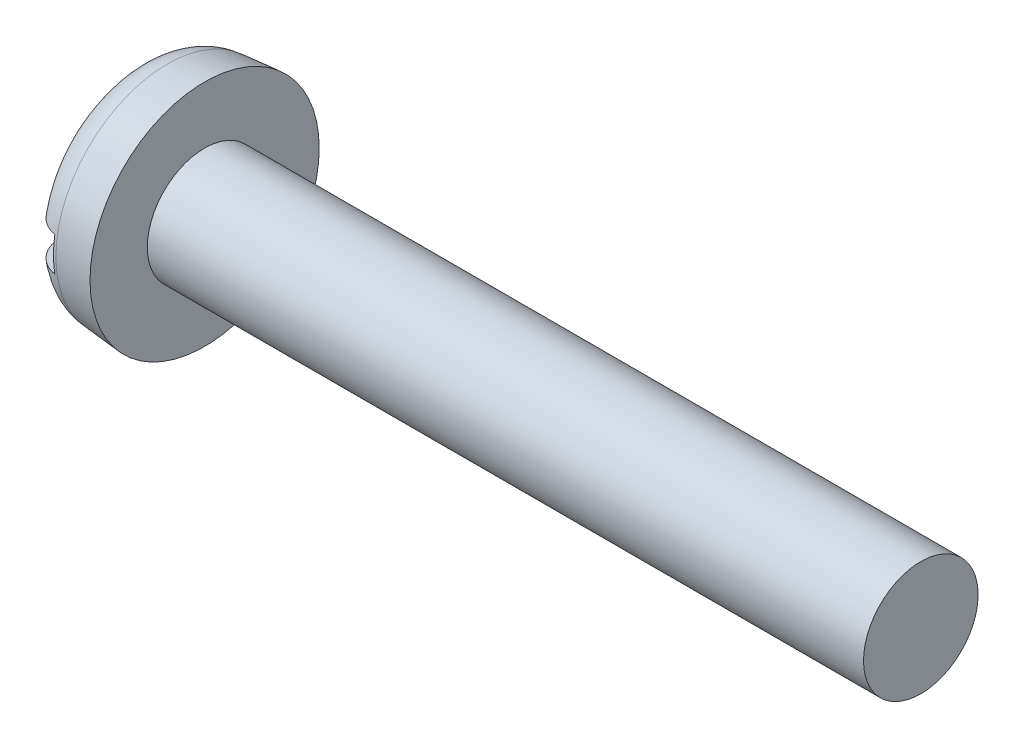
from build123d import *

# Parameters (mm, degrees)
FILLET2_R  = 1.2
SKETCH2_W  = 8
SKETCH2_H  = 1.2
SLOT_DEPTH = 1


with BuildPart() as part:
    # BodySke → Base-Revolve (revolve)
    with BuildSketch(Plane.XY, mode=Mode.PRIVATE) as base_revolve_sk:
        Polygon((2.4, 2), (2.4, 4), (0, 3.790027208), (0, 0), (27.4, 0), (27.4, 2), align=None)
    revolve(base_revolve_sk.sketch.rotate(Axis((-25.4, 0, 0), (1, 0, 0)), 90), axis=Axis((-25.4, 0, 0), (1, 0, 0)))

    # Fillet2
    fillet2_edges = [part.edges().sort_by_distance(p)[0] for p in [
        (0, 0, -3.790027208),
    ]]
    fillet(fillet2_edges, radius=FILLET2_R)

    # Sketch2 → Slot (cut)
    with BuildSketch(Plane(origin=(0, 0, 0), x_dir=(0, 0, -1), z_dir=(1, 0, 0))):
        Rectangle(SKETCH2_W, SKETCH2_H)
    extrude(amount=SLOT_DEPTH, mode=Mode.SUBTRACT)


solid = part.part
